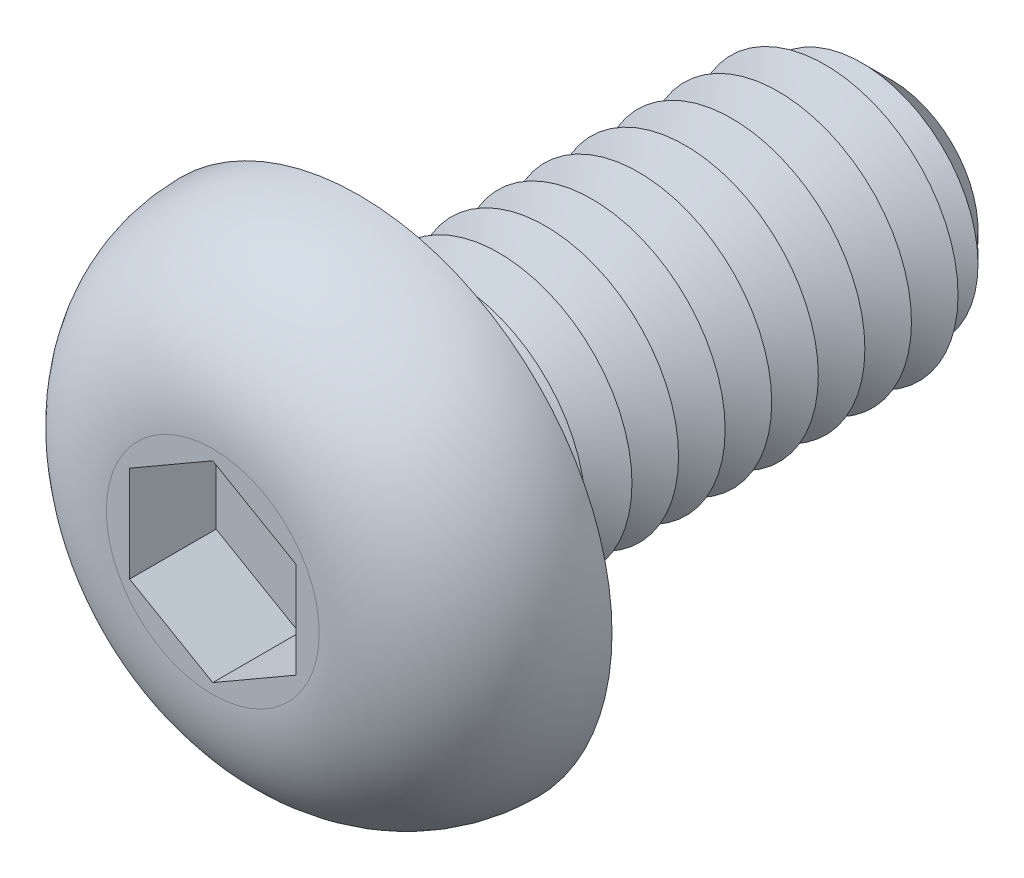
ISO-10303-21;
HEADER;
FILE_DESCRIPTION(('STEP AP214'),'2;1');
FILE_NAME('part.step','',(''),(''),'','','');
FILE_SCHEMA(('AUTOMOTIVE_DESIGN { 1 0 10303 214 1 1 1 1 }'));
ENDSEC;
DATA;
#1=APPLICATION_CONTEXT('core data for automotive mechanical design processes');
#2=APPLICATION_PROTOCOL_DEFINITION('international standard','automotive_design',2000,#1);
#3=PRODUCT_CONTEXT('',#1,'mechanical');
#4=PRODUCT('Part','Part','',(#3));
#5=PRODUCT_RELATED_PRODUCT_CATEGORY('part','',(#4));
#6=PRODUCT_DEFINITION_FORMATION('','',#4);
#7=PRODUCT_DEFINITION_CONTEXT('part definition',#1,'design');
#8=PRODUCT_DEFINITION('design','',#6,#7);
#9=PRODUCT_DEFINITION_SHAPE('','',#8);
#10=(LENGTH_UNIT() NAMED_UNIT(*) SI_UNIT(.MILLI.,.METRE.));
#11=(NAMED_UNIT(*) PLANE_ANGLE_UNIT() SI_UNIT($,.RADIAN.));
#12=(NAMED_UNIT(*) SI_UNIT($,.STERADIAN.) SOLID_ANGLE_UNIT());
#13=UNCERTAINTY_MEASURE_WITH_UNIT(LENGTH_MEASURE(1.E-05),#10,'distance_accuracy_value','');
#14=(GEOMETRIC_REPRESENTATION_CONTEXT(3) GLOBAL_UNCERTAINTY_ASSIGNED_CONTEXT((#13)) GLOBAL_UNIT_ASSIGNED_CONTEXT((#10,
#11,#12)) REPRESENTATION_CONTEXT('',''));
#15=CARTESIAN_POINT('',(0.,0.,0.));
#16=DIRECTION('',(0.,0.,1.));
#17=DIRECTION('',(1.,0.,0.));
#18=AXIS2_PLACEMENT_3D('',#15,#16,#17);
#19=CARTESIAN_POINT('',(0.,0.,-8.));
#20=DIRECTION('',(0.,0.,1.));
#21=DIRECTION('',(1.,0.,0.));
#22=AXIS2_PLACEMENT_3D('',#19,#20,#21);
#23=CYLINDRICAL_SURFACE('',#22,2.);
#24=CARTESIAN_POINT('',(0.,0.,-0.35));
#25=DIRECTION('',(0.,0.,1.));
#26=DIRECTION('',(1.,0.,0.));
#27=AXIS2_PLACEMENT_3D('',#24,#25,#26);
#28=CIRCLE('',#27,2.);
#29=CARTESIAN_POINT('',(2.,0.,-0.35));
#30=VERTEX_POINT('',#29);
#31=EDGE_CURVE('E48',#30,#30,#28,.F.);
#32=ORIENTED_EDGE('',*,*,#31,.T.);
#33=EDGE_LOOP('',(#32));
#34=FACE_BOUND('',#33,.T.);
#35=CARTESIAN_POINT('',(0.,0.,-0.699999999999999));
#36=DIRECTION('',(0.,0.,1.));
#37=DIRECTION('',(1.,0.,0.));
#38=AXIS2_PLACEMENT_3D('',#35,#36,#37);
#39=CIRCLE('',#38,2.);
#40=CARTESIAN_POINT('',(2.,0.,-0.699999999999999));
#41=VERTEX_POINT('',#40);
#42=EDGE_CURVE('E138',#41,#41,#39,.T.);
#43=ORIENTED_EDGE('',*,*,#42,.T.);
#44=EDGE_LOOP('',(#43));
#45=FACE_BOUND('',#44,.T.);
#46=ADVANCED_FACE('F39',(#34,#45),#23,.T.);
#47=CARTESIAN_POINT('',(0.,3.8,0.));
#48=DIRECTION('',(0.,0.,1.));
#49=DIRECTION('',(1.,0.,0.));
#50=AXIS2_PLACEMENT_3D('',#47,#48,#49);
#51=PLANE('',#50);
#52=CARTESIAN_POINT('',(0.,0.,0.));
#53=DIRECTION('',(0.,0.,1.));
#54=DIRECTION('',(1.,0.,0.));
#55=AXIS2_PLACEMENT_3D('',#52,#53,#54);
#56=CIRCLE('',#55,2.35);
#57=CARTESIAN_POINT('',(2.35,0.,0.));
#58=VERTEX_POINT('',#57);
#59=EDGE_CURVE('E11',#58,#58,#56,.T.);
#60=ORIENTED_EDGE('',*,*,#59,.T.);
#61=EDGE_LOOP('',(#60));
#62=FACE_BOUND('',#61,.T.);
#63=CARTESIAN_POINT('',(0.,0.,0.));
#64=DIRECTION('',(0.,0.,1.));
#65=DIRECTION('',(1.,0.,0.));
#66=AXIS2_PLACEMENT_3D('',#63,#64,#65);
#67=CIRCLE('',#66,3.8);
#68=CARTESIAN_POINT('',(3.8,0.,0.));
#69=VERTEX_POINT('',#68);
#70=EDGE_CURVE('E157',#69,#69,#67,.T.);
#71=ORIENTED_EDGE('',*,*,#70,.F.);
#72=EDGE_LOOP('',(#71));
#73=FACE_BOUND('',#72,.T.);
#74=ADVANCED_FACE('F204',(#62,#73),#51,.F.);
#75=CARTESIAN_POINT('',(0.,0.,2.2));
#76=DIRECTION('',(0.,0.,-1.));
#77=DIRECTION('',(-1.,0.,0.));
#78=AXIS2_PLACEMENT_3D('',#75,#76,#77);
#79=PLANE('',#78);
#80=DIRECTION('',(-0.866025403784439,-0.5,0.));
#81=VECTOR('',#80,1.);
#82=CARTESIAN_POINT('',(0.,1.44337567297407,2.2));
#83=LINE('',#82,#81);
#84=CARTESIAN_POINT('',(0.,1.44337567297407,2.2));
#85=VERTEX_POINT('',#84);
#86=CARTESIAN_POINT('',(-1.25,0.721687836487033,2.2));
#87=VERTEX_POINT('',#86);
#88=EDGE_CURVE('E137',#85,#87,#83,.T.);
#89=ORIENTED_EDGE('',*,*,#88,.F.);
#90=DIRECTION('',(-0.866025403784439,0.5,0.));
#91=VECTOR('',#90,1.);
#92=CARTESIAN_POINT('',(1.25,0.721687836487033,2.2));
#93=LINE('',#92,#91);
#94=CARTESIAN_POINT('',(1.25,0.721687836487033,2.2));
#95=VERTEX_POINT('',#94);
#96=EDGE_CURVE('E55',#95,#85,#93,.T.);
#97=ORIENTED_EDGE('',*,*,#96,.F.);
#98=DIRECTION('',(0.,1.,0.));
#99=VECTOR('',#98,1.);
#100=CARTESIAN_POINT('',(1.25,-0.721687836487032,2.2));
#101=LINE('',#100,#99);
#102=CARTESIAN_POINT('',(1.25,-0.721687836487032,2.2));
#103=VERTEX_POINT('',#102);
#104=EDGE_CURVE('E151',#103,#95,#101,.T.);
#105=ORIENTED_EDGE('',*,*,#104,.F.);
#106=DIRECTION('',(0.866025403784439,0.5,0.));
#107=VECTOR('',#106,1.);
#108=CARTESIAN_POINT('',(0.,-1.44337567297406,2.2));
#109=LINE('',#108,#107);
#110=CARTESIAN_POINT('',(0.,-1.44337567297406,2.2));
#111=VERTEX_POINT('',#110);
#112=EDGE_CURVE('E148',#111,#103,#109,.T.);
#113=ORIENTED_EDGE('',*,*,#112,.F.);
#114=DIRECTION('',(0.866025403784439,-0.5,0.));
#115=VECTOR('',#114,1.);
#116=CARTESIAN_POINT('',(-1.25,-0.721687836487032,2.2));
#117=LINE('',#116,#115);
#118=CARTESIAN_POINT('',(-1.25,-0.721687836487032,2.2));
#119=VERTEX_POINT('',#118);
#120=EDGE_CURVE('E103',#119,#111,#117,.T.);
#121=ORIENTED_EDGE('',*,*,#120,.F.);
#122=DIRECTION('',(0.,-1.,0.));
#123=VECTOR('',#122,1.);
#124=CARTESIAN_POINT('',(-1.25,0.721687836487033,2.2));
#125=LINE('',#124,#123);
#126=EDGE_CURVE('E142',#87,#119,#125,.T.);
#127=ORIENTED_EDGE('',*,*,#126,.F.);
#128=EDGE_LOOP('',(#89,#97,#105,#113,#121,#127));
#129=FACE_BOUND('',#128,.T.);
#130=CARTESIAN_POINT('',(0.,0.,2.2));
#131=DIRECTION('',(0.,0.,1.));
#132=DIRECTION('',(1.,0.,0.));
#133=AXIS2_PLACEMENT_3D('',#130,#131,#132);
#134=CIRCLE('',#133,1.6);
#135=CARTESIAN_POINT('',(1.6,0.,2.2));
#136=VERTEX_POINT('',#135);
#137=EDGE_CURVE('E170',#136,#136,#134,.T.);
#138=ORIENTED_EDGE('',*,*,#137,.T.);
#139=EDGE_LOOP('',(#138));
#140=FACE_BOUND('',#139,.T.);
#141=ADVANCED_FACE('F209',(#129,#140),#79,.F.);
#142=CARTESIAN_POINT('',(0.,0.,0.));
#143=DIRECTION('',(0.,0.,1.));
#144=DIRECTION('',(1.,0.,0.));
#145=AXIS2_PLACEMENT_3D('',#142,#143,#144);
#146=DEGENERATE_TOROIDAL_SURFACE('',#145,1.6,2.2,.T.);
#147=ORIENTED_EDGE('',*,*,#137,.F.);
#148=EDGE_LOOP('',(#147));
#149=FACE_BOUND('',#148,.T.);
#150=ORIENTED_EDGE('',*,*,#70,.T.);
#151=EDGE_LOOP('',(#150));
#152=FACE_BOUND('',#151,.T.);
#153=ADVANCED_FACE('F237',(#149,#152),#146,.T.);
#154=CARTESIAN_POINT('',(1.25,0.721687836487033,0.9));
#155=DIRECTION('',(0.5,0.866025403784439,0.));
#156=DIRECTION('',(-0.866025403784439,0.5,0.));
#157=AXIS2_PLACEMENT_3D('',#154,#155,#156);
#158=PLANE('',#157);
#159=ORIENTED_EDGE('',*,*,#96,.T.);
#160=DIRECTION('',(0.,0.,1.));
#161=VECTOR('',#160,1.);
#162=CARTESIAN_POINT('',(0.,1.44337567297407,0.9));
#163=LINE('',#162,#161);
#164=CARTESIAN_POINT('',(0.,1.44337567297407,0.9));
#165=VERTEX_POINT('',#164);
#166=EDGE_CURVE('E85',#165,#85,#163,.T.);
#167=ORIENTED_EDGE('',*,*,#166,.F.);
#168=DIRECTION('',(-0.866025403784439,0.5,0.));
#169=VECTOR('',#168,1.);
#170=CARTESIAN_POINT('',(1.25,0.721687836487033,0.9));
#171=LINE('',#170,#169);
#172=CARTESIAN_POINT('',(1.25,0.721687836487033,0.9));
#173=VERTEX_POINT('',#172);
#174=EDGE_CURVE('E154',#173,#165,#171,.T.);
#175=ORIENTED_EDGE('',*,*,#174,.F.);
#176=DIRECTION('',(0.,0.,1.));
#177=VECTOR('',#176,1.);
#178=CARTESIAN_POINT('',(1.25,0.721687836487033,0.9));
#179=LINE('',#178,#177);
#180=EDGE_CURVE('E63',#173,#95,#179,.T.);
#181=ORIENTED_EDGE('',*,*,#180,.T.);
#182=EDGE_LOOP('',(#159,#167,#175,#181));
#183=FACE_BOUND('',#182,.T.);
#184=ADVANCED_FACE('F223',(#183),#158,.F.);
#185=CARTESIAN_POINT('',(1.25,-0.721687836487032,0.9));
#186=DIRECTION('',(1.,0.,0.));
#187=DIRECTION('',(0.,1.,0.));
#188=AXIS2_PLACEMENT_3D('',#185,#186,#187);
#189=PLANE('',#188);
#190=ORIENTED_EDGE('',*,*,#104,.T.);
#191=ORIENTED_EDGE('',*,*,#180,.F.);
#192=DIRECTION('',(0.,1.,0.));
#193=VECTOR('',#192,1.);
#194=CARTESIAN_POINT('',(1.25,-0.721687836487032,0.9));
#195=LINE('',#194,#193);
#196=CARTESIAN_POINT('',(1.25,-0.721687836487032,0.9));
#197=VERTEX_POINT('',#196);
#198=EDGE_CURVE('E117',#197,#173,#195,.T.);
#199=ORIENTED_EDGE('',*,*,#198,.F.);
#200=DIRECTION('',(0.,0.,1.));
#201=VECTOR('',#200,1.);
#202=CARTESIAN_POINT('',(1.25,-0.721687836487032,0.9));
#203=LINE('',#202,#201);
#204=EDGE_CURVE('E108',#197,#103,#203,.T.);
#205=ORIENTED_EDGE('',*,*,#204,.T.);
#206=EDGE_LOOP('',(#190,#191,#199,#205));
#207=FACE_BOUND('',#206,.T.);
#208=ADVANCED_FACE('F220',(#207),#189,.F.);
#209=CARTESIAN_POINT('',(0.,-1.44337567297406,0.9));
#210=DIRECTION('',(0.5,-0.866025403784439,0.));
#211=DIRECTION('',(0.866025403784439,0.5,0.));
#212=AXIS2_PLACEMENT_3D('',#209,#210,#211);
#213=PLANE('',#212);
#214=ORIENTED_EDGE('',*,*,#112,.T.);
#215=ORIENTED_EDGE('',*,*,#204,.F.);
#216=DIRECTION('',(0.866025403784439,0.5,0.));
#217=VECTOR('',#216,1.);
#218=CARTESIAN_POINT('',(0.,-1.44337567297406,0.9));
#219=LINE('',#218,#217);
#220=CARTESIAN_POINT('',(0.,-1.44337567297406,0.9));
#221=VERTEX_POINT('',#220);
#222=EDGE_CURVE('E112',#221,#197,#219,.T.);
#223=ORIENTED_EDGE('',*,*,#222,.F.);
#224=DIRECTION('',(0.,0.,1.));
#225=VECTOR('',#224,1.);
#226=CARTESIAN_POINT('',(0.,-1.44337567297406,0.9));
#227=LINE('',#226,#225);
#228=EDGE_CURVE('E96',#221,#111,#227,.T.);
#229=ORIENTED_EDGE('',*,*,#228,.T.);
#230=EDGE_LOOP('',(#214,#215,#223,#229));
#231=FACE_BOUND('',#230,.T.);
#232=ADVANCED_FACE('F113',(#231),#213,.F.);
#233=CARTESIAN_POINT('',(-1.25,-0.721687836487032,0.9));
#234=DIRECTION('',(-0.5,-0.866025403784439,0.));
#235=DIRECTION('',(0.866025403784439,-0.5,0.));
#236=AXIS2_PLACEMENT_3D('',#233,#234,#235);
#237=PLANE('',#236);
#238=ORIENTED_EDGE('',*,*,#120,.T.);
#239=ORIENTED_EDGE('',*,*,#228,.F.);
#240=DIRECTION('',(0.866025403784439,-0.5,0.));
#241=VECTOR('',#240,1.);
#242=CARTESIAN_POINT('',(-1.25,-0.721687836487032,0.9));
#243=LINE('',#242,#241);
#244=CARTESIAN_POINT('',(-1.25,-0.721687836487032,0.9));
#245=VERTEX_POINT('',#244);
#246=EDGE_CURVE('E100',#245,#221,#243,.T.);
#247=ORIENTED_EDGE('',*,*,#246,.F.);
#248=DIRECTION('',(0.,0.,1.));
#249=VECTOR('',#248,1.);
#250=CARTESIAN_POINT('',(-1.25,-0.721687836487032,0.9));
#251=LINE('',#250,#249);
#252=EDGE_CURVE('E109',#245,#119,#251,.T.);
#253=ORIENTED_EDGE('',*,*,#252,.T.);
#254=EDGE_LOOP('',(#238,#239,#247,#253));
#255=FACE_BOUND('',#254,.T.);
#256=ADVANCED_FACE('F98',(#255),#237,.F.);
#257=CARTESIAN_POINT('',(-1.25,0.721687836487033,0.9));
#258=DIRECTION('',(-1.,0.,0.));
#259=DIRECTION('',(0.,-1.,0.));
#260=AXIS2_PLACEMENT_3D('',#257,#258,#259);
#261=PLANE('',#260);
#262=ORIENTED_EDGE('',*,*,#126,.T.);
#263=ORIENTED_EDGE('',*,*,#252,.F.);
#264=DIRECTION('',(0.,-1.,0.));
#265=VECTOR('',#264,1.);
#266=CARTESIAN_POINT('',(-1.25,0.721687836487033,0.9));
#267=LINE('',#266,#265);
#268=CARTESIAN_POINT('',(-1.25,0.721687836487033,0.9));
#269=VERTEX_POINT('',#268);
#270=EDGE_CURVE('E123',#269,#245,#267,.T.);
#271=ORIENTED_EDGE('',*,*,#270,.F.);
#272=DIRECTION('',(0.,0.,1.));
#273=VECTOR('',#272,1.);
#274=CARTESIAN_POINT('',(-1.25,0.721687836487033,0.9));
#275=LINE('',#274,#273);
#276=EDGE_CURVE('E162',#269,#87,#275,.T.);
#277=ORIENTED_EDGE('',*,*,#276,.T.);
#278=EDGE_LOOP('',(#262,#263,#271,#277));
#279=FACE_BOUND('',#278,.T.);
#280=ADVANCED_FACE('F228',(#279),#261,.F.);
#281=CARTESIAN_POINT('',(0.,1.44337567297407,0.9));
#282=DIRECTION('',(-0.5,0.866025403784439,0.));
#283=DIRECTION('',(-0.866025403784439,-0.5,0.));
#284=AXIS2_PLACEMENT_3D('',#281,#282,#283);
#285=PLANE('',#284);
#286=ORIENTED_EDGE('',*,*,#88,.T.);
#287=ORIENTED_EDGE('',*,*,#276,.F.);
#288=DIRECTION('',(-0.866025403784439,-0.5,0.));
#289=VECTOR('',#288,1.);
#290=CARTESIAN_POINT('',(0.,1.44337567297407,0.9));
#291=LINE('',#290,#289);
#292=EDGE_CURVE('E129',#165,#269,#291,.T.);
#293=ORIENTED_EDGE('',*,*,#292,.F.);
#294=ORIENTED_EDGE('',*,*,#166,.T.);
#295=EDGE_LOOP('',(#286,#287,#293,#294));
#296=FACE_BOUND('',#295,.T.);
#297=ADVANCED_FACE('F218',(#296),#285,.F.);
#298=CARTESIAN_POINT('',(0.,0.,0.9));
#299=DIRECTION('',(0.,0.,1.));
#300=DIRECTION('',(1.,0.,0.));
#301=AXIS2_PLACEMENT_3D('',#298,#299,#300);
#302=PLANE('',#301);
#303=CARTESIAN_POINT('',(0.,0.,0.9));
#304=DIRECTION('',(0.,0.,1.));
#305=DIRECTION('',(1.,0.,0.));
#306=AXIS2_PLACEMENT_3D('',#303,#304,#305);
#307=CIRCLE('',#306,0.5);
#308=CARTESIAN_POINT('',(0.5,0.,0.9));
#309=VERTEX_POINT('',#308);
#310=EDGE_CURVE('E336',#309,#309,#307,.T.);
#311=ORIENTED_EDGE('',*,*,#310,.F.);
#312=EDGE_LOOP('',(#311));
#313=FACE_BOUND('',#312,.T.);
#314=ORIENTED_EDGE('',*,*,#174,.T.);
#315=ORIENTED_EDGE('',*,*,#292,.T.);
#316=ORIENTED_EDGE('',*,*,#270,.T.);
#317=ORIENTED_EDGE('',*,*,#246,.T.);
#318=ORIENTED_EDGE('',*,*,#222,.T.);
#319=ORIENTED_EDGE('',*,*,#198,.T.);
#320=EDGE_LOOP('',(#314,#315,#316,#317,#318,#319));
#321=FACE_BOUND('',#320,.T.);
#322=ADVANCED_FACE('F120',(#313,#321),#302,.T.);
#323=CARTESIAN_POINT('',(0.,0.,-0.699999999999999));
#324=DIRECTION('',(0.,0.,1.));
#325=DIRECTION('',(1.,0.,0.));
#326=AXIS2_PLACEMENT_3D('',#323,#324,#325);
#327=CONICAL_SURFACE('',#326,2.,1.04719755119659);
#328=CARTESIAN_POINT('',(0.,0.,-1.05));
#329=DIRECTION('',(0.,0.,1.));
#330=DIRECTION('',(1.,0.,0.));
#331=AXIS2_PLACEMENT_3D('',#328,#329,#330);
#332=CIRCLE('',#331,1.39378221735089);
#333=CARTESIAN_POINT('',(1.39378221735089,0.,-1.05));
#334=VERTEX_POINT('',#333);
#335=EDGE_CURVE('E260',#334,#334,#332,.T.);
#336=ORIENTED_EDGE('',*,*,#335,.T.);
#337=EDGE_LOOP('',(#336));
#338=FACE_BOUND('',#337,.T.);
#339=ORIENTED_EDGE('',*,*,#42,.F.);
#340=EDGE_LOOP('',(#339));
#341=FACE_BOUND('',#340,.T.);
#342=ADVANCED_FACE('F217',(#338,#341),#327,.T.);
#343=CARTESIAN_POINT('',(0.,0.,-1.05));
#344=DIRECTION('',(0.,0.,-1.));
#345=DIRECTION('',(-1.,0.,0.));
#346=AXIS2_PLACEMENT_3D('',#343,#344,#345);
#347=CONICAL_SURFACE('',#346,1.39378221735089,1.0471975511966);
#348=CARTESIAN_POINT('',(0.,0.,-1.4));
#349=DIRECTION('',(0.,0.,1.));
#350=DIRECTION('',(1.,0.,0.));
#351=AXIS2_PLACEMENT_3D('',#348,#349,#350);
#352=CIRCLE('',#351,2.);
#353=CARTESIAN_POINT('',(2.,0.,-1.4));
#354=VERTEX_POINT('',#353);
#355=EDGE_CURVE('E264',#354,#354,#352,.T.);
#356=ORIENTED_EDGE('',*,*,#355,.T.);
#357=EDGE_LOOP('',(#356));
#358=FACE_BOUND('',#357,.T.);
#359=ORIENTED_EDGE('',*,*,#335,.F.);
#360=EDGE_LOOP('',(#359));
#361=FACE_BOUND('',#360,.T.);
#362=ADVANCED_FACE('F453',(#358,#361),#347,.T.);
#363=CARTESIAN_POINT('',(0.,0.,-1.4));
#364=DIRECTION('',(0.,0.,1.));
#365=DIRECTION('',(1.,0.,0.));
#366=AXIS2_PLACEMENT_3D('',#363,#364,#365);
#367=CONICAL_SURFACE('',#366,2.,1.04719755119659);
#368=CARTESIAN_POINT('',(0.,0.,-1.75));
#369=DIRECTION('',(0.,0.,1.));
#370=DIRECTION('',(1.,0.,0.));
#371=AXIS2_PLACEMENT_3D('',#368,#369,#370);
#372=CIRCLE('',#371,1.39378221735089);
#373=CARTESIAN_POINT('',(1.39378221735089,0.,-1.75));
#374=VERTEX_POINT('',#373);
#375=EDGE_CURVE('E268',#374,#374,#372,.T.);
#376=ORIENTED_EDGE('',*,*,#375,.T.);
#377=EDGE_LOOP('',(#376));
#378=FACE_BOUND('',#377,.T.);
#379=ORIENTED_EDGE('',*,*,#355,.F.);
#380=EDGE_LOOP('',(#379));
#381=FACE_BOUND('',#380,.T.);
#382=ADVANCED_FACE('F447',(#378,#381),#367,.T.);
#383=CARTESIAN_POINT('',(0.,0.,-1.75));
#384=DIRECTION('',(0.,0.,-1.));
#385=DIRECTION('',(-1.,0.,0.));
#386=AXIS2_PLACEMENT_3D('',#383,#384,#385);
#387=CONICAL_SURFACE('',#386,1.39378221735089,1.0471975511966);
#388=CARTESIAN_POINT('',(0.,0.,-2.1));
#389=DIRECTION('',(0.,0.,1.));
#390=DIRECTION('',(1.,0.,0.));
#391=AXIS2_PLACEMENT_3D('',#388,#389,#390);
#392=CIRCLE('',#391,2.);
#393=CARTESIAN_POINT('',(2.,0.,-2.1));
#394=VERTEX_POINT('',#393);
#395=EDGE_CURVE('E272',#394,#394,#392,.T.);
#396=ORIENTED_EDGE('',*,*,#395,.T.);
#397=EDGE_LOOP('',(#396));
#398=FACE_BOUND('',#397,.T.);
#399=ORIENTED_EDGE('',*,*,#375,.F.);
#400=EDGE_LOOP('',(#399));
#401=FACE_BOUND('',#400,.T.);
#402=ADVANCED_FACE('F441',(#398,#401),#387,.T.);
#403=CARTESIAN_POINT('',(0.,0.,-2.1));
#404=DIRECTION('',(0.,0.,1.));
#405=DIRECTION('',(1.,0.,0.));
#406=AXIS2_PLACEMENT_3D('',#403,#404,#405);
#407=CONICAL_SURFACE('',#406,2.,1.04719755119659);
#408=CARTESIAN_POINT('',(0.,0.,-2.45));
#409=DIRECTION('',(0.,0.,1.));
#410=DIRECTION('',(1.,0.,0.));
#411=AXIS2_PLACEMENT_3D('',#408,#409,#410);
#412=CIRCLE('',#411,1.39378221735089);
#413=CARTESIAN_POINT('',(1.39378221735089,0.,-2.45));
#414=VERTEX_POINT('',#413);
#415=EDGE_CURVE('E276',#414,#414,#412,.T.);
#416=ORIENTED_EDGE('',*,*,#415,.T.);
#417=EDGE_LOOP('',(#416));
#418=FACE_BOUND('',#417,.T.);
#419=ORIENTED_EDGE('',*,*,#395,.F.);
#420=EDGE_LOOP('',(#419));
#421=FACE_BOUND('',#420,.T.);
#422=ADVANCED_FACE('F435',(#418,#421),#407,.T.);
#423=CARTESIAN_POINT('',(0.,0.,-2.45));
#424=DIRECTION('',(0.,0.,-1.));
#425=DIRECTION('',(-1.,0.,0.));
#426=AXIS2_PLACEMENT_3D('',#423,#424,#425);
#427=CONICAL_SURFACE('',#426,1.39378221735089,1.0471975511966);
#428=CARTESIAN_POINT('',(0.,0.,-2.8));
#429=DIRECTION('',(0.,0.,1.));
#430=DIRECTION('',(1.,0.,0.));
#431=AXIS2_PLACEMENT_3D('',#428,#429,#430);
#432=CIRCLE('',#431,2.);
#433=CARTESIAN_POINT('',(2.,0.,-2.8));
#434=VERTEX_POINT('',#433);
#435=EDGE_CURVE('E280',#434,#434,#432,.T.);
#436=ORIENTED_EDGE('',*,*,#435,.T.);
#437=EDGE_LOOP('',(#436));
#438=FACE_BOUND('',#437,.T.);
#439=ORIENTED_EDGE('',*,*,#415,.F.);
#440=EDGE_LOOP('',(#439));
#441=FACE_BOUND('',#440,.T.);
#442=ADVANCED_FACE('F429',(#438,#441),#427,.T.);
#443=CARTESIAN_POINT('',(0.,0.,-2.8));
#444=DIRECTION('',(0.,0.,1.));
#445=DIRECTION('',(1.,0.,0.));
#446=AXIS2_PLACEMENT_3D('',#443,#444,#445);
#447=CONICAL_SURFACE('',#446,2.,1.04719755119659);
#448=CARTESIAN_POINT('',(0.,0.,-3.15));
#449=DIRECTION('',(0.,0.,1.));
#450=DIRECTION('',(1.,0.,0.));
#451=AXIS2_PLACEMENT_3D('',#448,#449,#450);
#452=CIRCLE('',#451,1.39378221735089);
#453=CARTESIAN_POINT('',(1.39378221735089,0.,-3.15));
#454=VERTEX_POINT('',#453);
#455=EDGE_CURVE('E284',#454,#454,#452,.T.);
#456=ORIENTED_EDGE('',*,*,#455,.T.);
#457=EDGE_LOOP('',(#456));
#458=FACE_BOUND('',#457,.T.);
#459=ORIENTED_EDGE('',*,*,#435,.F.);
#460=EDGE_LOOP('',(#459));
#461=FACE_BOUND('',#460,.T.);
#462=ADVANCED_FACE('F423',(#458,#461),#447,.T.);
#463=CARTESIAN_POINT('',(0.,0.,-3.15));
#464=DIRECTION('',(0.,0.,-1.));
#465=DIRECTION('',(-1.,0.,0.));
#466=AXIS2_PLACEMENT_3D('',#463,#464,#465);
#467=CONICAL_SURFACE('',#466,1.39378221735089,1.0471975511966);
#468=CARTESIAN_POINT('',(0.,0.,-3.5));
#469=DIRECTION('',(0.,0.,1.));
#470=DIRECTION('',(1.,0.,0.));
#471=AXIS2_PLACEMENT_3D('',#468,#469,#470);
#472=CIRCLE('',#471,2.);
#473=CARTESIAN_POINT('',(2.,0.,-3.5));
#474=VERTEX_POINT('',#473);
#475=EDGE_CURVE('E288',#474,#474,#472,.T.);
#476=ORIENTED_EDGE('',*,*,#475,.T.);
#477=EDGE_LOOP('',(#476));
#478=FACE_BOUND('',#477,.T.);
#479=ORIENTED_EDGE('',*,*,#455,.F.);
#480=EDGE_LOOP('',(#479));
#481=FACE_BOUND('',#480,.T.);
#482=ADVANCED_FACE('F417',(#478,#481),#467,.T.);
#483=CARTESIAN_POINT('',(0.,0.,-3.5));
#484=DIRECTION('',(0.,0.,1.));
#485=DIRECTION('',(1.,0.,0.));
#486=AXIS2_PLACEMENT_3D('',#483,#484,#485);
#487=CONICAL_SURFACE('',#486,2.,1.04719755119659);
#488=CARTESIAN_POINT('',(0.,0.,-3.85));
#489=DIRECTION('',(0.,0.,1.));
#490=DIRECTION('',(1.,0.,0.));
#491=AXIS2_PLACEMENT_3D('',#488,#489,#490);
#492=CIRCLE('',#491,1.39378221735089);
#493=CARTESIAN_POINT('',(1.39378221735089,0.,-3.85));
#494=VERTEX_POINT('',#493);
#495=EDGE_CURVE('E291',#494,#494,#492,.T.);
#496=ORIENTED_EDGE('',*,*,#495,.T.);
#497=EDGE_LOOP('',(#496));
#498=FACE_BOUND('',#497,.T.);
#499=ORIENTED_EDGE('',*,*,#475,.F.);
#500=EDGE_LOOP('',(#499));
#501=FACE_BOUND('',#500,.T.);
#502=ADVANCED_FACE('F411',(#498,#501),#487,.T.);
#503=CARTESIAN_POINT('',(0.,0.,-3.85));
#504=DIRECTION('',(0.,0.,-1.));
#505=DIRECTION('',(-1.,0.,0.));
#506=AXIS2_PLACEMENT_3D('',#503,#504,#505);
#507=CONICAL_SURFACE('',#506,1.39378221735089,1.0471975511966);
#508=CARTESIAN_POINT('',(0.,0.,-4.2));
#509=DIRECTION('',(0.,0.,1.));
#510=DIRECTION('',(1.,0.,0.));
#511=AXIS2_PLACEMENT_3D('',#508,#509,#510);
#512=CIRCLE('',#511,2.);
#513=CARTESIAN_POINT('',(2.,0.,-4.2));
#514=VERTEX_POINT('',#513);
#515=EDGE_CURVE('E295',#514,#514,#512,.T.);
#516=ORIENTED_EDGE('',*,*,#515,.T.);
#517=EDGE_LOOP('',(#516));
#518=FACE_BOUND('',#517,.T.);
#519=ORIENTED_EDGE('',*,*,#495,.F.);
#520=EDGE_LOOP('',(#519));
#521=FACE_BOUND('',#520,.T.);
#522=ADVANCED_FACE('F405',(#518,#521),#507,.T.);
#523=CARTESIAN_POINT('',(0.,0.,-4.2));
#524=DIRECTION('',(0.,0.,1.));
#525=DIRECTION('',(1.,0.,0.));
#526=AXIS2_PLACEMENT_3D('',#523,#524,#525);
#527=CONICAL_SURFACE('',#526,2.,1.04719755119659);
#528=CARTESIAN_POINT('',(0.,0.,-4.55));
#529=DIRECTION('',(0.,0.,1.));
#530=DIRECTION('',(1.,0.,0.));
#531=AXIS2_PLACEMENT_3D('',#528,#529,#530);
#532=CIRCLE('',#531,1.39378221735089);
#533=CARTESIAN_POINT('',(1.39378221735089,0.,-4.55));
#534=VERTEX_POINT('',#533);
#535=EDGE_CURVE('E299',#534,#534,#532,.T.);
#536=ORIENTED_EDGE('',*,*,#535,.T.);
#537=EDGE_LOOP('',(#536));
#538=FACE_BOUND('',#537,.T.);
#539=ORIENTED_EDGE('',*,*,#515,.F.);
#540=EDGE_LOOP('',(#539));
#541=FACE_BOUND('',#540,.T.);
#542=ADVANCED_FACE('F399',(#538,#541),#527,.T.);
#543=CARTESIAN_POINT('',(0.,0.,-4.55));
#544=DIRECTION('',(0.,0.,-1.));
#545=DIRECTION('',(-1.,0.,0.));
#546=AXIS2_PLACEMENT_3D('',#543,#544,#545);
#547=CONICAL_SURFACE('',#546,1.39378221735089,1.0471975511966);
#548=CARTESIAN_POINT('',(0.,0.,-4.9));
#549=DIRECTION('',(0.,0.,1.));
#550=DIRECTION('',(1.,0.,0.));
#551=AXIS2_PLACEMENT_3D('',#548,#549,#550);
#552=CIRCLE('',#551,2.);
#553=CARTESIAN_POINT('',(2.,0.,-4.9));
#554=VERTEX_POINT('',#553);
#555=EDGE_CURVE('E303',#554,#554,#552,.T.);
#556=ORIENTED_EDGE('',*,*,#555,.T.);
#557=EDGE_LOOP('',(#556));
#558=FACE_BOUND('',#557,.T.);
#559=ORIENTED_EDGE('',*,*,#535,.F.);
#560=EDGE_LOOP('',(#559));
#561=FACE_BOUND('',#560,.T.);
#562=ADVANCED_FACE('F393',(#558,#561),#547,.T.);
#563=CARTESIAN_POINT('',(0.,0.,-4.9));
#564=DIRECTION('',(0.,0.,1.));
#565=DIRECTION('',(1.,0.,0.));
#566=AXIS2_PLACEMENT_3D('',#563,#564,#565);
#567=CONICAL_SURFACE('',#566,2.,1.04719755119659);
#568=CARTESIAN_POINT('',(0.,0.,-5.25));
#569=DIRECTION('',(0.,0.,1.));
#570=DIRECTION('',(1.,0.,0.));
#571=AXIS2_PLACEMENT_3D('',#568,#569,#570);
#572=CIRCLE('',#571,1.39378221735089);
#573=CARTESIAN_POINT('',(1.39378221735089,0.,-5.25));
#574=VERTEX_POINT('',#573);
#575=EDGE_CURVE('E307',#574,#574,#572,.T.);
#576=ORIENTED_EDGE('',*,*,#575,.T.);
#577=EDGE_LOOP('',(#576));
#578=FACE_BOUND('',#577,.T.);
#579=ORIENTED_EDGE('',*,*,#555,.F.);
#580=EDGE_LOOP('',(#579));
#581=FACE_BOUND('',#580,.T.);
#582=ADVANCED_FACE('F387',(#578,#581),#567,.T.);
#583=CARTESIAN_POINT('',(0.,0.,-5.25));
#584=DIRECTION('',(0.,0.,-1.));
#585=DIRECTION('',(-1.,0.,0.));
#586=AXIS2_PLACEMENT_3D('',#583,#584,#585);
#587=CONICAL_SURFACE('',#586,1.39378221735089,1.0471975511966);
#588=CARTESIAN_POINT('',(0.,0.,-5.6));
#589=DIRECTION('',(0.,0.,1.));
#590=DIRECTION('',(1.,0.,0.));
#591=AXIS2_PLACEMENT_3D('',#588,#589,#590);
#592=CIRCLE('',#591,2.);
#593=CARTESIAN_POINT('',(2.,0.,-5.6));
#594=VERTEX_POINT('',#593);
#595=EDGE_CURVE('E311',#594,#594,#592,.T.);
#596=ORIENTED_EDGE('',*,*,#595,.T.);
#597=EDGE_LOOP('',(#596));
#598=FACE_BOUND('',#597,.T.);
#599=ORIENTED_EDGE('',*,*,#575,.F.);
#600=EDGE_LOOP('',(#599));
#601=FACE_BOUND('',#600,.T.);
#602=ADVANCED_FACE('F381',(#598,#601),#587,.T.);
#603=CARTESIAN_POINT('',(0.,0.,-5.6));
#604=DIRECTION('',(0.,0.,1.));
#605=DIRECTION('',(1.,0.,0.));
#606=AXIS2_PLACEMENT_3D('',#603,#604,#605);
#607=CONICAL_SURFACE('',#606,2.,1.04719755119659);
#608=CARTESIAN_POINT('',(0.,0.,-5.95));
#609=DIRECTION('',(0.,0.,1.));
#610=DIRECTION('',(1.,0.,0.));
#611=AXIS2_PLACEMENT_3D('',#608,#609,#610);
#612=CIRCLE('',#611,1.39378221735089);
#613=CARTESIAN_POINT('',(1.39378221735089,0.,-5.95));
#614=VERTEX_POINT('',#613);
#615=EDGE_CURVE('E315',#614,#614,#612,.T.);
#616=ORIENTED_EDGE('',*,*,#615,.T.);
#617=EDGE_LOOP('',(#616));
#618=FACE_BOUND('',#617,.T.);
#619=ORIENTED_EDGE('',*,*,#595,.F.);
#620=EDGE_LOOP('',(#619));
#621=FACE_BOUND('',#620,.T.);
#622=ADVANCED_FACE('F375',(#618,#621),#607,.T.);
#623=CARTESIAN_POINT('',(0.,0.,-5.95));
#624=DIRECTION('',(0.,0.,-1.));
#625=DIRECTION('',(-1.,0.,0.));
#626=AXIS2_PLACEMENT_3D('',#623,#624,#625);
#627=CONICAL_SURFACE('',#626,1.39378221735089,1.0471975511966);
#628=CARTESIAN_POINT('',(0.,0.,-6.3));
#629=DIRECTION('',(0.,0.,1.));
#630=DIRECTION('',(1.,0.,0.));
#631=AXIS2_PLACEMENT_3D('',#628,#629,#630);
#632=CIRCLE('',#631,2.);
#633=CARTESIAN_POINT('',(2.,0.,-6.3));
#634=VERTEX_POINT('',#633);
#635=EDGE_CURVE('E319',#634,#634,#632,.T.);
#636=ORIENTED_EDGE('',*,*,#635,.T.);
#637=EDGE_LOOP('',(#636));
#638=FACE_BOUND('',#637,.T.);
#639=ORIENTED_EDGE('',*,*,#615,.F.);
#640=EDGE_LOOP('',(#639));
#641=FACE_BOUND('',#640,.T.);
#642=ADVANCED_FACE('F369',(#638,#641),#627,.T.);
#643=CARTESIAN_POINT('',(0.,0.,-6.3));
#644=DIRECTION('',(0.,0.,1.));
#645=DIRECTION('',(1.,0.,0.));
#646=AXIS2_PLACEMENT_3D('',#643,#644,#645);
#647=CONICAL_SURFACE('',#646,2.,1.04719755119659);
#648=CARTESIAN_POINT('',(0.,0.,-6.65));
#649=DIRECTION('',(0.,0.,1.));
#650=DIRECTION('',(1.,0.,0.));
#651=AXIS2_PLACEMENT_3D('',#648,#649,#650);
#652=CIRCLE('',#651,1.39378221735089);
#653=CARTESIAN_POINT('',(1.39378221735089,0.,-6.65));
#654=VERTEX_POINT('',#653);
#655=EDGE_CURVE('E181',#654,#654,#652,.T.);
#656=ORIENTED_EDGE('',*,*,#655,.T.);
#657=EDGE_LOOP('',(#656));
#658=FACE_BOUND('',#657,.T.);
#659=ORIENTED_EDGE('',*,*,#635,.F.);
#660=EDGE_LOOP('',(#659));
#661=FACE_BOUND('',#660,.T.);
#662=ADVANCED_FACE('F363',(#658,#661),#647,.T.);
#663=CARTESIAN_POINT('',(0.,0.,-6.65));
#664=DIRECTION('',(0.,0.,-1.));
#665=DIRECTION('',(-1.,0.,0.));
#666=AXIS2_PLACEMENT_3D('',#663,#664,#665);
#667=CONICAL_SURFACE('',#666,1.39378221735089,1.0471975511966);
#668=CARTESIAN_POINT('',(0.,0.,-7.));
#669=DIRECTION('',(0.,0.,1.));
#670=DIRECTION('',(1.,0.,0.));
#671=AXIS2_PLACEMENT_3D('',#668,#669,#670);
#672=CIRCLE('',#671,2.);
#673=CARTESIAN_POINT('',(2.,0.,-7.));
#674=VERTEX_POINT('',#673);
#675=EDGE_CURVE('E182',#674,#674,#672,.T.);
#676=ORIENTED_EDGE('',*,*,#675,.T.);
#677=EDGE_LOOP('',(#676));
#678=FACE_BOUND('',#677,.T.);
#679=ORIENTED_EDGE('',*,*,#655,.F.);
#680=EDGE_LOOP('',(#679));
#681=FACE_BOUND('',#680,.T.);
#682=ADVANCED_FACE('F357',(#678,#681),#667,.T.);
#683=CARTESIAN_POINT('',(0.,0.,-7.));
#684=DIRECTION('',(0.,0.,1.));
#685=DIRECTION('',(1.,0.,0.));
#686=AXIS2_PLACEMENT_3D('',#683,#684,#685);
#687=CONICAL_SURFACE('',#686,2.,1.04719755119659);
#688=CARTESIAN_POINT('',(0.,0.,-7.35));
#689=DIRECTION('',(0.,0.,1.));
#690=DIRECTION('',(1.,0.,0.));
#691=AXIS2_PLACEMENT_3D('',#688,#689,#690);
#692=CIRCLE('',#691,1.39378221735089);
#693=CARTESIAN_POINT('',(1.39378221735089,0.,-7.35));
#694=VERTEX_POINT('',#693);
#695=EDGE_CURVE('E329',#694,#694,#692,.T.);
#696=ORIENTED_EDGE('',*,*,#695,.T.);
#697=EDGE_LOOP('',(#696));
#698=FACE_BOUND('',#697,.T.);
#699=ORIENTED_EDGE('',*,*,#675,.F.);
#700=EDGE_LOOP('',(#699));
#701=FACE_BOUND('',#700,.T.);
#702=ADVANCED_FACE('F351',(#698,#701),#687,.T.);
#703=CARTESIAN_POINT('',(0.,0.,-7.35));
#704=DIRECTION('',(0.,0.,-1.));
#705=DIRECTION('',(-1.,0.,0.));
#706=AXIS2_PLACEMENT_3D('',#703,#704,#705);
#707=CONICAL_SURFACE('',#706,1.39378221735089,1.0471975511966);
#708=CARTESIAN_POINT('',(0.,0.,-7.55358983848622));
#709=DIRECTION('',(0.,0.,-1.));
#710=DIRECTION('',(-1.,0.,0.));
#711=AXIS2_PLACEMENT_3D('',#708,#709,#710);
#712=CIRCLE('',#711,1.74641016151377);
#713=CARTESIAN_POINT('',(-1.74641016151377,0.,-7.55358983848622));
#714=VERTEX_POINT('',#713);
#715=EDGE_CURVE('E178',#714,#714,#712,.T.);
#716=ORIENTED_EDGE('',*,*,#715,.F.);
#717=EDGE_LOOP('',(#716));
#718=FACE_BOUND('',#717,.T.);
#719=ORIENTED_EDGE('',*,*,#695,.F.);
#720=EDGE_LOOP('',(#719));
#721=FACE_BOUND('',#720,.T.);
#722=ADVANCED_FACE('F344',(#718,#721),#707,.T.);
#723=CARTESIAN_POINT('',(0.,0.,-8.));
#724=DIRECTION('',(0.,0.,-1.));
#725=DIRECTION('',(-1.,0.,0.));
#726=AXIS2_PLACEMENT_3D('',#723,#724,#725);
#727=PLANE('',#726);
#728=CARTESIAN_POINT('',(0.,0.,-8.));
#729=DIRECTION('',(0.,0.,-1.));
#730=DIRECTION('',(-1.,0.,0.));
#731=AXIS2_PLACEMENT_3D('',#728,#729,#730);
#732=CIRCLE('',#731,0.5);
#733=CARTESIAN_POINT('',(-0.5,0.,-8.));
#734=VERTEX_POINT('',#733);
#735=EDGE_CURVE('E333',#734,#734,#732,.F.);
#736=ORIENTED_EDGE('',*,*,#735,.T.);
#737=EDGE_LOOP('',(#736));
#738=FACE_BOUND('',#737,.T.);
#739=CARTESIAN_POINT('',(0.,0.,-8.));
#740=DIRECTION('',(0.,0.,-1.));
#741=DIRECTION('',(-1.,0.,0.));
#742=AXIS2_PLACEMENT_3D('',#739,#740,#741);
#743=CIRCLE('',#742,1.3);
#744=CARTESIAN_POINT('',(-1.3,0.,-8.));
#745=VERTEX_POINT('',#744);
#746=EDGE_CURVE('E174',#745,#745,#743,.T.);
#747=ORIENTED_EDGE('',*,*,#746,.T.);
#748=EDGE_LOOP('',(#747));
#749=FACE_BOUND('',#748,.T.);
#750=ADVANCED_FACE('F200',(#738,#749),#727,.T.);
#751=CARTESIAN_POINT('',(0.,0.,-8.));
#752=DIRECTION('',(0.,0.,1.));
#753=DIRECTION('',(1.,0.,0.));
#754=AXIS2_PLACEMENT_3D('',#751,#752,#753);
#755=CONICAL_SURFACE('',#754,1.3,0.785398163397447);
#756=ORIENTED_EDGE('',*,*,#746,.F.);
#757=EDGE_LOOP('',(#756));
#758=FACE_BOUND('',#757,.T.);
#759=ORIENTED_EDGE('',*,*,#715,.T.);
#760=EDGE_LOOP('',(#759));
#761=FACE_BOUND('',#760,.T.);
#762=ADVANCED_FACE('F192',(#758,#761),#755,.T.);
#763=CARTESIAN_POINT('',(0.,0.,-0.35));
#764=DIRECTION('',(0.,0.,1.));
#765=DIRECTION('',(1.,0.,0.));
#766=AXIS2_PLACEMENT_3D('',#763,#764,#765);
#767=TOROIDAL_SURFACE('',#766,2.35,0.35);
#768=ORIENTED_EDGE('',*,*,#59,.F.);
#769=EDGE_LOOP('',(#768));
#770=FACE_BOUND('',#769,.T.);
#771=ORIENTED_EDGE('',*,*,#31,.F.);
#772=EDGE_LOOP('',(#771));
#773=FACE_BOUND('',#772,.T.);
#774=ADVANCED_FACE('F41',(#770,#773),#767,.F.);
#775=CARTESIAN_POINT('',(0.,0.,-9.41421356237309));
#776=DIRECTION('',(0.,0.,1.));
#777=DIRECTION('',(1.,0.,0.));
#778=AXIS2_PLACEMENT_3D('',#775,#776,#777);
#779=CYLINDRICAL_SURFACE('',#778,0.5);
#780=ORIENTED_EDGE('',*,*,#310,.T.);
#781=EDGE_LOOP('',(#780));
#782=FACE_BOUND('',#781,.T.);
#783=ORIENTED_EDGE('',*,*,#735,.F.);
#784=EDGE_LOOP('',(#783));
#785=FACE_BOUND('',#784,.T.);
#786=ADVANCED_FACE('F191',(#782,#785),#779,.F.);
#787=CLOSED_SHELL('',(#46,#74,#141,#153,#184,#208,#232,#256,#280,#297,#322,#342,#362,#382,#402,
#422,#442,#462,#482,#502,#522,#542,#562,#582,#602,#622,#642,#662,#682,#702,#722,#750,#762,#774,#786));
#788=MANIFOLD_SOLID_BREP('B2',#787);
#789=ADVANCED_BREP_SHAPE_REPRESENTATION('',(#18,#788),#14);
#790=SHAPE_DEFINITION_REPRESENTATION(#9,#789);
ENDSEC;
END-ISO-10303-21;
